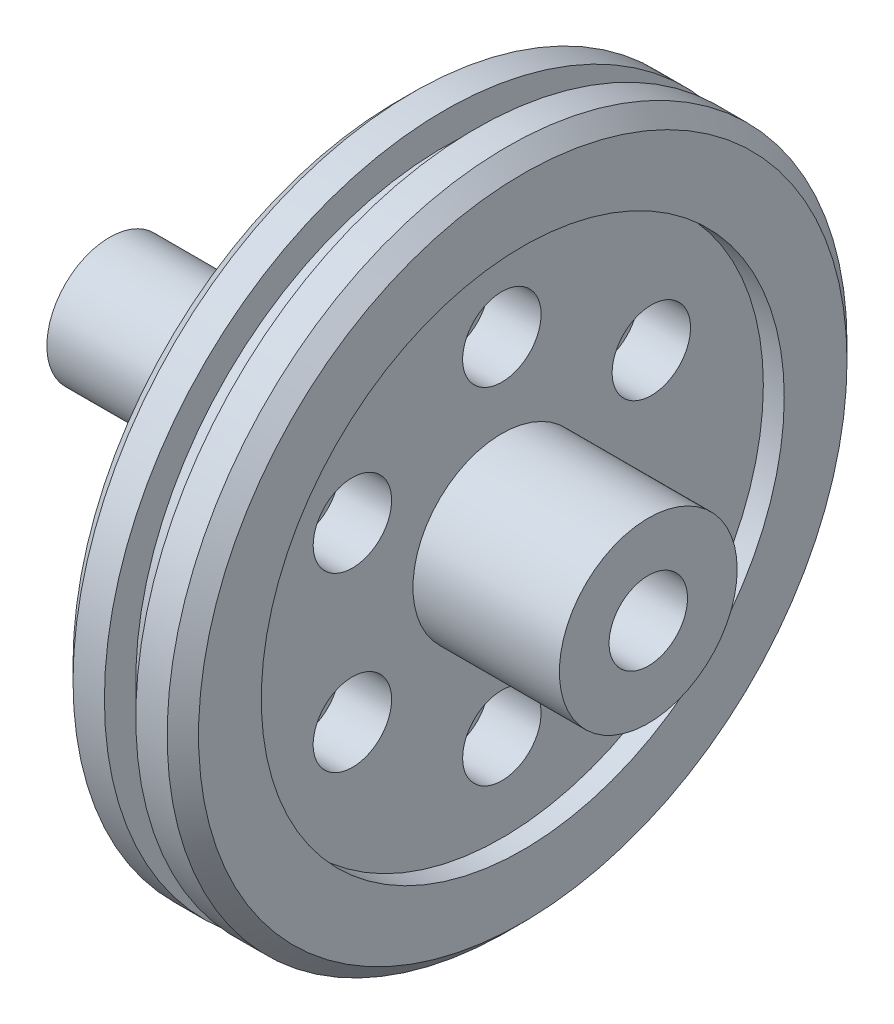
ISO-10303-21;
HEADER;
FILE_DESCRIPTION(('STEP AP214'),'2;1');
FILE_NAME('part.step','',(''),(''),'','','');
FILE_SCHEMA(('AUTOMOTIVE_DESIGN { 1 0 10303 214 1 1 1 1 }'));
ENDSEC;
DATA;
#1=APPLICATION_CONTEXT('core data for automotive mechanical design processes');
#2=APPLICATION_PROTOCOL_DEFINITION('international standard','automotive_design',2000,#1);
#3=PRODUCT_CONTEXT('',#1,'mechanical');
#4=PRODUCT('Part','Part','',(#3));
#5=PRODUCT_RELATED_PRODUCT_CATEGORY('part','',(#4));
#6=PRODUCT_DEFINITION_FORMATION('','',#4);
#7=PRODUCT_DEFINITION_CONTEXT('part definition',#1,'design');
#8=PRODUCT_DEFINITION('design','',#6,#7);
#9=PRODUCT_DEFINITION_SHAPE('','',#8);
#10=(LENGTH_UNIT() NAMED_UNIT(*) SI_UNIT(.MILLI.,.METRE.));
#11=(NAMED_UNIT(*) PLANE_ANGLE_UNIT() SI_UNIT($,.RADIAN.));
#12=(NAMED_UNIT(*) SI_UNIT($,.STERADIAN.) SOLID_ANGLE_UNIT());
#13=UNCERTAINTY_MEASURE_WITH_UNIT(LENGTH_MEASURE(1.E-05),#10,'distance_accuracy_value','');
#14=(GEOMETRIC_REPRESENTATION_CONTEXT(3) GLOBAL_UNCERTAINTY_ASSIGNED_CONTEXT((#13)) GLOBAL_UNIT_ASSIGNED_CONTEXT((#10,
#11,#12)) REPRESENTATION_CONTEXT('',''));
#15=CARTESIAN_POINT('',(0.,0.,0.));
#16=DIRECTION('',(0.,0.,1.));
#17=DIRECTION('',(1.,0.,0.));
#18=AXIS2_PLACEMENT_3D('',#15,#16,#17);
#19=CARTESIAN_POINT('',(80.,0.,0.));
#20=DIRECTION('',(1.,0.,0.));
#21=DIRECTION('',(0.,0.,-1.));
#22=AXIS2_PLACEMENT_3D('',#19,#20,#21);
#23=CYLINDRICAL_SURFACE('',#22,65.);
#24=CARTESIAN_POINT('',(-27.,0.,0.));
#25=DIRECTION('',(1.,0.,0.));
#26=DIRECTION('',(0.,0.,-1.));
#27=AXIS2_PLACEMENT_3D('',#24,#25,#26);
#28=CIRCLE('',#27,65.);
#29=CARTESIAN_POINT('',(-27.,0.,-65.));
#30=VERTEX_POINT('',#29);
#31=EDGE_CURVE('E84',#30,#30,#28,.F.);
#32=ORIENTED_EDGE('',*,*,#31,.T.);
#33=EDGE_LOOP('',(#32));
#34=FACE_BOUND('',#33,.T.);
#35=CARTESIAN_POINT('',(-33.,0.,0.));
#36=DIRECTION('',(1.,0.,0.));
#37=DIRECTION('',(0.,0.,-1.));
#38=AXIS2_PLACEMENT_3D('',#35,#36,#37);
#39=CIRCLE('',#38,65.);
#40=CARTESIAN_POINT('',(-33.,0.,-65.));
#41=VERTEX_POINT('',#40);
#42=EDGE_CURVE('E71',#41,#41,#39,.F.);
#43=ORIENTED_EDGE('',*,*,#42,.F.);
#44=EDGE_LOOP('',(#43));
#45=FACE_BOUND('',#44,.T.);
#46=ADVANCED_FACE('F24',(#34,#45),#23,.T.);
#47=CARTESIAN_POINT('',(-24.,17.,0.));
#48=DIRECTION('',(1.,0.,0.));
#49=DIRECTION('',(0.,0.,-1.));
#50=AXIS2_PLACEMENT_3D('',#47,#48,#49);
#51=PLANE('',#50);
#52=CARTESIAN_POINT('',(-24.,0.,0.));
#53=DIRECTION('',(1.,0.,0.));
#54=DIRECTION('',(0.,0.,-1.));
#55=AXIS2_PLACEMENT_3D('',#52,#53,#54);
#56=CIRCLE('',#55,50.);
#57=CARTESIAN_POINT('',(-24.,0.,-50.));
#58=VERTEX_POINT('',#57);
#59=EDGE_CURVE('E48',#58,#58,#56,.T.);
#60=ORIENTED_EDGE('',*,*,#59,.F.);
#61=EDGE_LOOP('',(#60));
#62=FACE_BOUND('',#61,.T.);
#63=CARTESIAN_POINT('',(-24.,0.,0.));
#64=DIRECTION('',(1.,0.,0.));
#65=DIRECTION('',(0.,0.,-1.));
#66=AXIS2_PLACEMENT_3D('',#63,#64,#65);
#67=CIRCLE('',#66,61.9999999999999);
#68=CARTESIAN_POINT('',(-24.,0.,-61.9999999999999));
#69=VERTEX_POINT('',#68);
#70=EDGE_CURVE('E77',#69,#69,#67,.T.);
#71=ORIENTED_EDGE('',*,*,#70,.T.);
#72=EDGE_LOOP('',(#71));
#73=FACE_BOUND('',#72,.T.);
#74=ADVANCED_FACE('F166',(#62,#73),#51,.T.);
#75=CARTESIAN_POINT('',(-33.,70.,0.));
#76=DIRECTION('',(1.,0.,0.));
#77=DIRECTION('',(0.,0.,-1.));
#78=AXIS2_PLACEMENT_3D('',#75,#76,#77);
#79=PLANE('',#78);
#80=ORIENTED_EDGE('',*,*,#42,.T.);
#81=EDGE_LOOP('',(#80));
#82=FACE_BOUND('',#81,.T.);
#83=CARTESIAN_POINT('',(-33.,0.,0.));
#84=DIRECTION('',(1.,0.,0.));
#85=DIRECTION('',(0.,0.,-1.));
#86=AXIS2_PLACEMENT_3D('',#83,#84,#85);
#87=CIRCLE('',#86,59.);
#88=CARTESIAN_POINT('',(-33.,0.,-59.));
#89=VERTEX_POINT('',#88);
#90=EDGE_CURVE('E63',#89,#89,#87,.T.);
#91=ORIENTED_EDGE('',*,*,#90,.T.);
#92=EDGE_LOOP('',(#91));
#93=FACE_BOUND('',#92,.T.);
#94=ADVANCED_FACE('F169',(#82,#93),#79,.F.);
#95=CARTESIAN_POINT('',(20.,0.,0.));
#96=DIRECTION('',(1.,0.,0.));
#97=DIRECTION('',(0.,0.,-1.));
#98=AXIS2_PLACEMENT_3D('',#95,#96,#97);
#99=CYLINDRICAL_SURFACE('',#98,59.);
#100=ORIENTED_EDGE('',*,*,#90,.F.);
#101=EDGE_LOOP('',(#100));
#102=FACE_BOUND('',#101,.T.);
#103=CARTESIAN_POINT('',(-39.,0.,0.));
#104=DIRECTION('',(1.,0.,0.));
#105=DIRECTION('',(0.,0.,-1.));
#106=AXIS2_PLACEMENT_3D('',#103,#104,#105);
#107=CIRCLE('',#106,59.);
#108=CARTESIAN_POINT('',(-39.,0.,-59.));
#109=VERTEX_POINT('',#108);
#110=EDGE_CURVE('E60',#109,#109,#107,.T.);
#111=ORIENTED_EDGE('',*,*,#110,.T.);
#112=EDGE_LOOP('',(#111));
#113=FACE_BOUND('',#112,.T.);
#114=ADVANCED_FACE('F208',(#102,#113),#99,.T.);
#115=CARTESIAN_POINT('',(-39.,70.,0.));
#116=DIRECTION('',(-1.,0.,0.));
#117=DIRECTION('',(0.,0.,1.));
#118=AXIS2_PLACEMENT_3D('',#115,#116,#117);
#119=PLANE('',#118);
#120=CARTESIAN_POINT('',(-39.,0.,0.));
#121=DIRECTION('',(-1.,0.,0.));
#122=DIRECTION('',(0.,0.,1.));
#123=AXIS2_PLACEMENT_3D('',#120,#121,#122);
#124=CIRCLE('',#123,65.);
#125=CARTESIAN_POINT('',(-39.,0.,65.));
#126=VERTEX_POINT('',#125);
#127=EDGE_CURVE('E66',#126,#126,#124,.F.);
#128=ORIENTED_EDGE('',*,*,#127,.T.);
#129=EDGE_LOOP('',(#128));
#130=FACE_BOUND('',#129,.T.);
#131=ORIENTED_EDGE('',*,*,#110,.F.);
#132=EDGE_LOOP('',(#131));
#133=FACE_BOUND('',#132,.T.);
#134=ADVANCED_FACE('F197',(#130,#133),#119,.F.);
#135=CARTESIAN_POINT('',(-48.,65.,0.));
#136=DIRECTION('',(-1.,0.,0.));
#137=DIRECTION('',(0.,0.,1.));
#138=AXIS2_PLACEMENT_3D('',#135,#136,#137);
#139=PLANE('',#138);
#140=CARTESIAN_POINT('',(-48.,0.,0.));
#141=DIRECTION('',(-1.,0.,0.));
#142=DIRECTION('',(0.,0.,1.));
#143=AXIS2_PLACEMENT_3D('',#140,#141,#142);
#144=CIRCLE('',#143,46.5);
#145=CARTESIAN_POINT('',(-48.,0.,46.5));
#146=VERTEX_POINT('',#145);
#147=EDGE_CURVE('E115',#146,#146,#144,.T.);
#148=ORIENTED_EDGE('',*,*,#147,.F.);
#149=EDGE_LOOP('',(#148));
#150=FACE_BOUND('',#149,.T.);
#151=CARTESIAN_POINT('',(-48.,0.,0.));
#152=DIRECTION('',(-1.,0.,0.));
#153=DIRECTION('',(0.,0.,1.));
#154=AXIS2_PLACEMENT_3D('',#151,#152,#153);
#155=CIRCLE('',#154,62.);
#156=CARTESIAN_POINT('',(-48.,0.,62.));
#157=VERTEX_POINT('',#156);
#158=EDGE_CURVE('E90',#157,#157,#155,.T.);
#159=ORIENTED_EDGE('',*,*,#158,.T.);
#160=EDGE_LOOP('',(#159));
#161=FACE_BOUND('',#160,.T.);
#162=ADVANCED_FACE('F184',(#150,#161),#139,.T.);
#163=CARTESIAN_POINT('',(-44.9999999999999,0.,0.));
#164=DIRECTION('',(-1.,0.,0.));
#165=DIRECTION('',(0.,0.,1.));
#166=AXIS2_PLACEMENT_3D('',#163,#164,#165);
#167=CIRCLE('',#166,65.);
#168=CARTESIAN_POINT('',(-44.9999999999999,0.,65.));
#169=VERTEX_POINT('',#168);
#170=EDGE_CURVE('E87',#169,#169,#167,.F.);
#171=ORIENTED_EDGE('',*,*,#170,.T.);
#172=EDGE_LOOP('',(#171));
#173=FACE_BOUND('',#172,.T.);
#174=ORIENTED_EDGE('',*,*,#127,.F.);
#175=EDGE_LOOP('',(#174));
#176=FACE_BOUND('',#175,.T.);
#177=ADVANCED_FACE('F175',(#173,#176),#23,.T.);
#178=CARTESIAN_POINT('',(-24.,0.,0.));
#179=DIRECTION('',(-1.,0.,0.));
#180=DIRECTION('',(0.,0.,1.));
#181=AXIS2_PLACEMENT_3D('',#178,#179,#180);
#182=CONICAL_SURFACE('',#181,62.,0.785398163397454);
#183=ORIENTED_EDGE('',*,*,#31,.F.);
#184=EDGE_LOOP('',(#183));
#185=FACE_BOUND('',#184,.T.);
#186=ORIENTED_EDGE('',*,*,#70,.F.);
#187=EDGE_LOOP('',(#186));
#188=FACE_BOUND('',#187,.T.);
#189=ADVANCED_FACE('F173',(#185,#188),#182,.T.);
#190=CARTESIAN_POINT('',(-44.9999999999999,0.,0.));
#191=DIRECTION('',(1.,0.,0.));
#192=DIRECTION('',(0.,0.,-1.));
#193=AXIS2_PLACEMENT_3D('',#190,#191,#192);
#194=CONICAL_SURFACE('',#193,65.,0.785398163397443);
#195=ORIENTED_EDGE('',*,*,#158,.F.);
#196=EDGE_LOOP('',(#195));
#197=FACE_BOUND('',#196,.T.);
#198=ORIENTED_EDGE('',*,*,#170,.F.);
#199=EDGE_LOOP('',(#198));
#200=FACE_BOUND('',#199,.T.);
#201=ADVANCED_FACE('F162',(#197,#200),#194,.T.);
#202=CARTESIAN_POINT('',(-28.,0.,0.));
#203=DIRECTION('',(1.,0.,0.));
#204=DIRECTION('',(0.,0.,-1.));
#205=AXIS2_PLACEMENT_3D('',#202,#203,#204);
#206=CYLINDRICAL_SURFACE('',#205,50.);
#207=CARTESIAN_POINT('',(-28.,0.,0.));
#208=DIRECTION('',(1.,0.,0.));
#209=DIRECTION('',(0.,0.,-1.));
#210=AXIS2_PLACEMENT_3D('',#207,#208,#209);
#211=CIRCLE('',#210,50.);
#212=CARTESIAN_POINT('',(-28.,0.,-50.));
#213=VERTEX_POINT('',#212);
#214=EDGE_CURVE('E57',#213,#213,#211,.T.);
#215=ORIENTED_EDGE('',*,*,#214,.F.);
#216=EDGE_LOOP('',(#215));
#217=FACE_BOUND('',#216,.T.);
#218=ORIENTED_EDGE('',*,*,#59,.T.);
#219=EDGE_LOOP('',(#218));
#220=FACE_BOUND('',#219,.T.);
#221=ADVANCED_FACE('F155',(#217,#220),#206,.F.);
#222=CARTESIAN_POINT('',(-28.,0.,0.));
#223=DIRECTION('',(1.,0.,0.));
#224=DIRECTION('',(0.,0.,-1.));
#225=AXIS2_PLACEMENT_3D('',#222,#223,#224);
#226=PLANE('',#225);
#227=CARTESIAN_POINT('',(-28.,16.5000000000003,-28.5788383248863));
#228=DIRECTION('',(1.,0.,0.));
#229=DIRECTION('',(0.,-0.866025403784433,-0.50000000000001));
#230=AXIS2_PLACEMENT_3D('',#227,#228,#229);
#231=CIRCLE('',#230,7.5);
#232=CARTESIAN_POINT('',(-28.,10.0048094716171,-32.3288383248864));
#233=VERTEX_POINT('',#232);
#234=EDGE_CURVE('E433',#233,#233,#231,.T.);
#235=ORIENTED_EDGE('',*,*,#234,.F.);
#236=EDGE_LOOP('',(#235));
#237=FACE_BOUND('',#236,.T.);
#238=CARTESIAN_POINT('',(-28.,-16.4999999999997,-28.5788383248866));
#239=DIRECTION('',(1.,0.,0.));
#240=DIRECTION('',(0.,-0.866025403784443,0.499999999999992));
#241=AXIS2_PLACEMENT_3D('',#238,#239,#240);
#242=CIRCLE('',#241,7.5);
#243=CARTESIAN_POINT('',(-28.,-22.9951905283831,-24.8288383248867));
#244=VERTEX_POINT('',#243);
#245=EDGE_CURVE('E432',#244,#244,#242,.T.);
#246=ORIENTED_EDGE('',*,*,#245,.F.);
#247=EDGE_LOOP('',(#246));
#248=FACE_BOUND('',#247,.T.);
#249=CARTESIAN_POINT('',(-28.,-33.,-2.30437901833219E-13));
#250=DIRECTION('',(1.,0.,0.));
#251=DIRECTION('',(0.,0.,1.));
#252=AXIS2_PLACEMENT_3D('',#249,#250,#251);
#253=CIRCLE('',#252,7.5);
#254=CARTESIAN_POINT('',(-28.,-33.0000000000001,7.49999999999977));
#255=VERTEX_POINT('',#254);
#256=EDGE_CURVE('E443',#255,#255,#253,.T.);
#257=ORIENTED_EDGE('',*,*,#256,.F.);
#258=EDGE_LOOP('',(#257));
#259=FACE_BOUND('',#258,.T.);
#260=CARTESIAN_POINT('',(-28.,-16.5000000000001,28.5788383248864));
#261=DIRECTION('',(1.,0.,0.));
#262=DIRECTION('',(0.,0.866025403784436,0.500000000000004));
#263=AXIS2_PLACEMENT_3D('',#260,#261,#262);
#264=CIRCLE('',#263,7.5);
#265=CARTESIAN_POINT('',(-28.,-10.0048094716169,32.3288383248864));
#266=VERTEX_POINT('',#265);
#267=EDGE_CURVE('E449',#266,#266,#264,.T.);
#268=ORIENTED_EDGE('',*,*,#267,.F.);
#269=EDGE_LOOP('',(#268));
#270=FACE_BOUND('',#269,.T.);
#271=CARTESIAN_POINT('',(-28.,16.4999999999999,28.5788383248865));
#272=DIRECTION('',(1.,0.,0.));
#273=DIRECTION('',(0.,0.86602540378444,-0.499999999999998));
#274=AXIS2_PLACEMENT_3D('',#271,#272,#273);
#275=CIRCLE('',#274,7.5);
#276=CARTESIAN_POINT('',(-28.,22.9951905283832,24.8288383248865));
#277=VERTEX_POINT('',#276);
#278=EDGE_CURVE('E455',#277,#277,#275,.T.);
#279=ORIENTED_EDGE('',*,*,#278,.F.);
#280=EDGE_LOOP('',(#279));
#281=FACE_BOUND('',#280,.T.);
#282=CARTESIAN_POINT('',(-28.,33.,0.));
#283=DIRECTION('',(1.,0.,0.));
#284=DIRECTION('',(0.,0.,-1.));
#285=AXIS2_PLACEMENT_3D('',#282,#283,#284);
#286=CIRCLE('',#285,7.5);
#287=CARTESIAN_POINT('',(-28.,33.,-7.5));
#288=VERTEX_POINT('',#287);
#289=EDGE_CURVE('E122',#288,#288,#286,.T.);
#290=ORIENTED_EDGE('',*,*,#289,.F.);
#291=EDGE_LOOP('',(#290));
#292=FACE_BOUND('',#291,.T.);
#293=CARTESIAN_POINT('',(-28.,0.,0.));
#294=DIRECTION('',(1.,0.,0.));
#295=DIRECTION('',(0.,0.,-1.));
#296=AXIS2_PLACEMENT_3D('',#293,#294,#295);
#297=CIRCLE('',#296,17.);
#298=CARTESIAN_POINT('',(-28.,0.,-17.));
#299=VERTEX_POINT('',#298);
#300=EDGE_CURVE('E44',#299,#299,#297,.T.);
#301=ORIENTED_EDGE('',*,*,#300,.F.);
#302=EDGE_LOOP('',(#301));
#303=FACE_BOUND('',#302,.T.);
#304=ORIENTED_EDGE('',*,*,#214,.T.);
#305=EDGE_LOOP('',(#304));
#306=FACE_BOUND('',#305,.T.);
#307=ADVANCED_FACE('F145',(#237,#248,#259,#270,#281,#292,#303,#306),#226,.T.);
#308=CARTESIAN_POINT('',(0.,0.,0.));
#309=DIRECTION('',(1.,0.,0.));
#310=DIRECTION('',(0.,0.,-1.));
#311=AXIS2_PLACEMENT_3D('',#308,#309,#310);
#312=PLANE('',#311);
#313=CARTESIAN_POINT('',(0.,0.,0.));
#314=DIRECTION('',(1.,0.,0.));
#315=DIRECTION('',(0.,0.,-1.));
#316=AXIS2_PLACEMENT_3D('',#313,#314,#315);
#317=CIRCLE('',#316,7.5);
#318=CARTESIAN_POINT('',(0.,0.,-7.5));
#319=VERTEX_POINT('',#318);
#320=EDGE_CURVE('E99',#319,#319,#317,.T.);
#321=ORIENTED_EDGE('',*,*,#320,.F.);
#322=EDGE_LOOP('',(#321));
#323=FACE_BOUND('',#322,.T.);
#324=CARTESIAN_POINT('',(0.,0.,0.));
#325=DIRECTION('',(1.,0.,0.));
#326=DIRECTION('',(0.,0.,-1.));
#327=AXIS2_PLACEMENT_3D('',#324,#325,#326);
#328=CIRCLE('',#327,17.);
#329=CARTESIAN_POINT('',(0.,0.,-17.));
#330=VERTEX_POINT('',#329);
#331=EDGE_CURVE('E74',#330,#330,#328,.T.);
#332=ORIENTED_EDGE('',*,*,#331,.T.);
#333=EDGE_LOOP('',(#332));
#334=FACE_BOUND('',#333,.T.);
#335=ADVANCED_FACE('F142',(#323,#334),#312,.T.);
#336=CARTESIAN_POINT('',(80.,0.,0.));
#337=DIRECTION('',(1.,0.,0.));
#338=DIRECTION('',(0.,0.,-1.));
#339=AXIS2_PLACEMENT_3D('',#336,#337,#338);
#340=CYLINDRICAL_SURFACE('',#339,17.);
#341=ORIENTED_EDGE('',*,*,#331,.F.);
#342=EDGE_LOOP('',(#341));
#343=FACE_BOUND('',#342,.T.);
#344=ORIENTED_EDGE('',*,*,#300,.T.);
#345=EDGE_LOOP('',(#344));
#346=FACE_BOUND('',#345,.T.);
#347=ADVANCED_FACE('F38',(#343,#346),#340,.T.);
#348=CARTESIAN_POINT('',(-29.,0.,0.));
#349=DIRECTION('',(1.,0.,0.));
#350=DIRECTION('',(0.,0.,-1.));
#351=AXIS2_PLACEMENT_3D('',#348,#349,#350);
#352=CONICAL_SURFACE('',#351,6.,1.02974425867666);
#353=CARTESIAN_POINT('',(-32.6051637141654,0.,0.));
#354=VERTEX_POINT('',#353);
#355=VERTEX_LOOP('',#354);
#356=FACE_BOUND('',#355,.T.);
#357=CARTESIAN_POINT('',(-29.,0.,0.));
#358=DIRECTION('',(1.,0.,0.));
#359=DIRECTION('',(0.,0.,-1.));
#360=AXIS2_PLACEMENT_3D('',#357,#358,#359);
#361=CIRCLE('',#360,6.);
#362=CARTESIAN_POINT('',(-29.,0.,-6.));
#363=VERTEX_POINT('',#362);
#364=EDGE_CURVE('E42',#363,#363,#361,.T.);
#365=ORIENTED_EDGE('',*,*,#364,.T.);
#366=EDGE_LOOP('',(#365));
#367=FACE_BOUND('',#366,.T.);
#368=ADVANCED_FACE('F34',(#356,#367),#352,.F.);
#369=CARTESIAN_POINT('',(0.,0.,0.));
#370=DIRECTION('',(1.,0.,0.));
#371=DIRECTION('',(0.,0.,-1.));
#372=AXIS2_PLACEMENT_3D('',#369,#370,#371);
#373=CYLINDRICAL_SURFACE('',#372,6.);
#374=ORIENTED_EDGE('',*,*,#364,.F.);
#375=EDGE_LOOP('',(#374));
#376=FACE_BOUND('',#375,.T.);
#377=CARTESIAN_POINT('',(-22.5,0.,0.));
#378=DIRECTION('',(1.,0.,0.));
#379=DIRECTION('',(0.,0.,-1.));
#380=AXIS2_PLACEMENT_3D('',#377,#378,#379);
#381=CIRCLE('',#380,6.);
#382=CARTESIAN_POINT('',(-22.5,0.,-6.));
#383=VERTEX_POINT('',#382);
#384=EDGE_CURVE('E45',#383,#383,#381,.T.);
#385=ORIENTED_EDGE('',*,*,#384,.T.);
#386=EDGE_LOOP('',(#385));
#387=FACE_BOUND('',#386,.T.);
#388=ADVANCED_FACE('F37',(#376,#387),#373,.F.);
#389=CARTESIAN_POINT('',(-21.,0.,0.));
#390=DIRECTION('',(1.,0.,0.));
#391=DIRECTION('',(0.,0.,-1.));
#392=AXIS2_PLACEMENT_3D('',#389,#390,#391);
#393=CONICAL_SURFACE('',#392,7.5,0.785398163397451);
#394=ORIENTED_EDGE('',*,*,#384,.F.);
#395=EDGE_LOOP('',(#394));
#396=FACE_BOUND('',#395,.T.);
#397=CARTESIAN_POINT('',(-21.,0.,0.));
#398=DIRECTION('',(1.,0.,0.));
#399=DIRECTION('',(0.,0.,-1.));
#400=AXIS2_PLACEMENT_3D('',#397,#398,#399);
#401=CIRCLE('',#400,7.5);
#402=CARTESIAN_POINT('',(-21.,0.,-7.5));
#403=VERTEX_POINT('',#402);
#404=EDGE_CURVE('E51',#403,#403,#401,.T.);
#405=ORIENTED_EDGE('',*,*,#404,.T.);
#406=EDGE_LOOP('',(#405));
#407=FACE_BOUND('',#406,.T.);
#408=ADVANCED_FACE('F134',(#396,#407),#393,.F.);
#409=CARTESIAN_POINT('',(0.,0.,0.));
#410=DIRECTION('',(1.,0.,0.));
#411=DIRECTION('',(0.,0.,-1.));
#412=AXIS2_PLACEMENT_3D('',#409,#410,#411);
#413=CYLINDRICAL_SURFACE('',#412,7.5);
#414=ORIENTED_EDGE('',*,*,#404,.F.);
#415=EDGE_LOOP('',(#414));
#416=FACE_BOUND('',#415,.T.);
#417=ORIENTED_EDGE('',*,*,#320,.T.);
#418=EDGE_LOOP('',(#417));
#419=FACE_BOUND('',#418,.T.);
#420=ADVANCED_FACE('F136',(#416,#419),#413,.F.);
#421=CARTESIAN_POINT('',(-44.,0.,0.));
#422=DIRECTION('',(-1.,0.,0.));
#423=DIRECTION('',(0.,0.,1.));
#424=AXIS2_PLACEMENT_3D('',#421,#422,#423);
#425=PLANE('',#424);
#426=CARTESIAN_POINT('',(-44.,0.,0.));
#427=DIRECTION('',(-1.,0.,0.));
#428=DIRECTION('',(0.,0.,1.));
#429=AXIS2_PLACEMENT_3D('',#426,#427,#428);
#430=CIRCLE('',#429,42.5);
#431=CARTESIAN_POINT('',(-44.,0.,42.5));
#432=VERTEX_POINT('',#431);
#433=EDGE_CURVE('E11',#432,#432,#430,.T.);
#434=ORIENTED_EDGE('',*,*,#433,.T.);
#435=EDGE_LOOP('',(#434));
#436=FACE_BOUND('',#435,.T.);
#437=CARTESIAN_POINT('',(-44.,0.,0.));
#438=DIRECTION('',(-1.,0.,0.));
#439=DIRECTION('',(0.,0.,1.));
#440=AXIS2_PLACEMENT_3D('',#437,#438,#439);
#441=CIRCLE('',#440,23.);
#442=CARTESIAN_POINT('',(-44.,0.,23.));
#443=VERTEX_POINT('',#442);
#444=EDGE_CURVE('E31',#443,#443,#441,.F.);
#445=ORIENTED_EDGE('',*,*,#444,.T.);
#446=EDGE_LOOP('',(#445));
#447=FACE_BOUND('',#446,.T.);
#448=ADVANCED_FACE('F103',(#436,#447),#425,.T.);
#449=CARTESIAN_POINT('',(-80.5000000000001,0.,0.));
#450=DIRECTION('',(0.,0.,1.));
#451=DIRECTION('',(1.,0.,0.));
#452=AXIS2_PLACEMENT_3D('',#449,#450,#451);
#453=SPHERICAL_SURFACE('',#452,25.4999999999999);
#454=CARTESIAN_POINT('',(-80.5000000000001,0.,0.));
#455=DIRECTION('',(1.,0.,0.));
#456=DIRECTION('',(0.,0.,-1.));
#457=AXIS2_PLACEMENT_3D('',#454,#455,#456);
#458=SPHERICAL_SURFACE('',#457,25.4999999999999);
#459=CARTESIAN_POINT('',(-103.,0.,0.));
#460=DIRECTION('',(1.,0.,0.));
#461=DIRECTION('',(0.,0.,-1.));
#462=AXIS2_PLACEMENT_3D('',#459,#460,#461);
#463=CIRCLE('',#462,12.);
#464=CARTESIAN_POINT('',(-103.,0.,-12.));
#465=VERTEX_POINT('',#464);
#466=EDGE_CURVE('E67',#465,#465,#463,.T.);
#467=ORIENTED_EDGE('',*,*,#466,.F.);
#468=EDGE_LOOP('',(#467));
#469=FACE_BOUND('',#468,.T.);
#470=ADVANCED_FACE('F26',(#469),#458,.T.);
#471=CARTESIAN_POINT('',(80.,0.,0.));
#472=DIRECTION('',(1.,0.,0.));
#473=DIRECTION('',(0.,0.,-1.));
#474=AXIS2_PLACEMENT_3D('',#471,#472,#473);
#475=CYLINDRICAL_SURFACE('',#474,12.);
#476=CARTESIAN_POINT('',(-70.,0.,0.));
#477=DIRECTION('',(-1.,0.,0.));
#478=DIRECTION('',(0.,0.,1.));
#479=AXIS2_PLACEMENT_3D('',#476,#477,#478);
#480=CIRCLE('',#479,12.);
#481=CARTESIAN_POINT('',(-70.,0.,12.));
#482=VERTEX_POINT('',#481);
#483=EDGE_CURVE('E93',#482,#482,#480,.F.);
#484=ORIENTED_EDGE('',*,*,#483,.F.);
#485=EDGE_LOOP('',(#484));
#486=FACE_BOUND('',#485,.T.);
#487=ORIENTED_EDGE('',*,*,#466,.T.);
#488=EDGE_LOOP('',(#487));
#489=FACE_BOUND('',#488,.T.);
#490=ADVANCED_FACE('F200',(#486,#489),#475,.T.);
#491=CARTESIAN_POINT('',(-70.,20.,0.));
#492=DIRECTION('',(-1.,0.,0.));
#493=DIRECTION('',(0.,0.,1.));
#494=AXIS2_PLACEMENT_3D('',#491,#492,#493);
#495=PLANE('',#494);
#496=ORIENTED_EDGE('',*,*,#483,.T.);
#497=EDGE_LOOP('',(#496));
#498=FACE_BOUND('',#497,.T.);
#499=CARTESIAN_POINT('',(-70.,0.,0.));
#500=DIRECTION('',(1.,0.,0.));
#501=DIRECTION('',(0.,0.,-1.));
#502=AXIS2_PLACEMENT_3D('',#499,#500,#501);
#503=CIRCLE('',#502,9.);
#504=CARTESIAN_POINT('',(-70.,0.,-9.));
#505=VERTEX_POINT('',#504);
#506=EDGE_CURVE('E119',#505,#505,#503,.T.);
#507=ORIENTED_EDGE('',*,*,#506,.F.);
#508=EDGE_LOOP('',(#507));
#509=FACE_BOUND('',#508,.T.);
#510=ADVANCED_FACE('F203',(#498,#509),#495,.F.);
#511=CARTESIAN_POINT('',(11.7710809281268,0.,0.));
#512=DIRECTION('',(1.,0.,0.));
#513=DIRECTION('',(0.,0.,-1.));
#514=AXIS2_PLACEMENT_3D('',#511,#512,#513);
#515=CYLINDRICAL_SURFACE('',#514,9.);
#516=CARTESIAN_POINT('',(-67.,0.,0.));
#517=DIRECTION('',(1.,0.,0.));
#518=DIRECTION('',(0.,0.,-1.));
#519=AXIS2_PLACEMENT_3D('',#516,#517,#518);
#520=CIRCLE('',#519,9.);
#521=CARTESIAN_POINT('',(-67.,0.,-9.));
#522=VERTEX_POINT('',#521);
#523=EDGE_CURVE('E97',#522,#522,#520,.T.);
#524=ORIENTED_EDGE('',*,*,#523,.F.);
#525=EDGE_LOOP('',(#524));
#526=FACE_BOUND('',#525,.T.);
#527=ORIENTED_EDGE('',*,*,#506,.T.);
#528=EDGE_LOOP('',(#527));
#529=FACE_BOUND('',#528,.T.);
#530=ADVANCED_FACE('F296',(#526,#529),#515,.T.);
#531=CARTESIAN_POINT('',(-67.,20.,0.));
#532=DIRECTION('',(1.,0.,0.));
#533=DIRECTION('',(0.,0.,-1.));
#534=AXIS2_PLACEMENT_3D('',#531,#532,#533);
#535=PLANE('',#534);
#536=CARTESIAN_POINT('',(-67.,0.,0.));
#537=DIRECTION('',(1.,0.,0.));
#538=DIRECTION('',(0.,0.,-1.));
#539=AXIS2_PLACEMENT_3D('',#536,#537,#538);
#540=CIRCLE('',#539,12.);
#541=CARTESIAN_POINT('',(-67.,0.,-12.));
#542=VERTEX_POINT('',#541);
#543=EDGE_CURVE('E96',#542,#542,#540,.F.);
#544=ORIENTED_EDGE('',*,*,#543,.T.);
#545=EDGE_LOOP('',(#544));
#546=FACE_BOUND('',#545,.T.);
#547=ORIENTED_EDGE('',*,*,#523,.T.);
#548=EDGE_LOOP('',(#547));
#549=FACE_BOUND('',#548,.T.);
#550=ADVANCED_FACE('F304',(#546,#549),#535,.F.);
#551=ORIENTED_EDGE('',*,*,#543,.F.);
#552=EDGE_LOOP('',(#551));
#553=FACE_BOUND('',#552,.T.);
#554=CARTESIAN_POINT('',(-48.,0.,0.));
#555=DIRECTION('',(1.,0.,0.));
#556=DIRECTION('',(0.,0.,-1.));
#557=AXIS2_PLACEMENT_3D('',#554,#555,#556);
#558=CIRCLE('',#557,12.);
#559=CARTESIAN_POINT('',(-48.,0.,-12.));
#560=VERTEX_POINT('',#559);
#561=EDGE_CURVE('E70',#560,#560,#558,.T.);
#562=ORIENTED_EDGE('',*,*,#561,.F.);
#563=EDGE_LOOP('',(#562));
#564=FACE_BOUND('',#563,.T.);
#565=ADVANCED_FACE('F205',(#553,#564),#475,.T.);
#566=ORIENTED_EDGE('',*,*,#561,.T.);
#567=EDGE_LOOP('',(#566));
#568=FACE_BOUND('',#567,.T.);
#569=CARTESIAN_POINT('',(-48.,0.,0.));
#570=DIRECTION('',(-1.,0.,0.));
#571=DIRECTION('',(0.,0.,1.));
#572=AXIS2_PLACEMENT_3D('',#569,#570,#571);
#573=CIRCLE('',#572,19.);
#574=CARTESIAN_POINT('',(-48.,0.,19.));
#575=VERTEX_POINT('',#574);
#576=EDGE_CURVE('E113',#575,#575,#573,.T.);
#577=ORIENTED_EDGE('',*,*,#576,.T.);
#578=EDGE_LOOP('',(#577));
#579=FACE_BOUND('',#578,.T.);
#580=ADVANCED_FACE('F199',(#568,#579),#139,.T.);
#581=CARTESIAN_POINT('',(-48.,0.,0.));
#582=DIRECTION('',(-1.,0.,0.));
#583=DIRECTION('',(0.,0.,1.));
#584=AXIS2_PLACEMENT_3D('',#581,#582,#583);
#585=TOROIDAL_SURFACE('',#584,42.5,4.);
#586=ORIENTED_EDGE('',*,*,#147,.T.);
#587=EDGE_LOOP('',(#586));
#588=FACE_BOUND('',#587,.T.);
#589=ORIENTED_EDGE('',*,*,#433,.F.);
#590=EDGE_LOOP('',(#589));
#591=FACE_BOUND('',#590,.T.);
#592=ADVANCED_FACE('F109',(#588,#591),#585,.F.);
#593=CARTESIAN_POINT('',(-48.,0.,0.));
#594=DIRECTION('',(-1.,0.,0.));
#595=DIRECTION('',(0.,0.,1.));
#596=AXIS2_PLACEMENT_3D('',#593,#594,#595);
#597=TOROIDAL_SURFACE('',#596,23.,4.);
#598=ORIENTED_EDGE('',*,*,#444,.F.);
#599=EDGE_LOOP('',(#598));
#600=FACE_BOUND('',#599,.T.);
#601=ORIENTED_EDGE('',*,*,#576,.F.);
#602=EDGE_LOOP('',(#601));
#603=FACE_BOUND('',#602,.T.);
#604=ADVANCED_FACE('F105',(#600,#603),#597,.F.);
#605=CARTESIAN_POINT('',(-38.,33.,0.));
#606=DIRECTION('',(1.,0.,0.));
#607=DIRECTION('',(0.,0.,-1.));
#608=AXIS2_PLACEMENT_3D('',#605,#606,#607);
#609=CYLINDRICAL_SURFACE('',#608,7.5);
#610=CARTESIAN_POINT('',(-38.,33.,0.));
#611=DIRECTION('',(1.,0.,0.));
#612=DIRECTION('',(0.,0.,-1.));
#613=AXIS2_PLACEMENT_3D('',#610,#611,#612);
#614=CIRCLE('',#613,7.5);
#615=CARTESIAN_POINT('',(-38.,33.,-7.5));
#616=VERTEX_POINT('',#615);
#617=EDGE_CURVE('E116',#616,#616,#614,.T.);
#618=ORIENTED_EDGE('',*,*,#617,.F.);
#619=EDGE_LOOP('',(#618));
#620=FACE_BOUND('',#619,.T.);
#621=ORIENTED_EDGE('',*,*,#289,.T.);
#622=EDGE_LOOP('',(#621));
#623=FACE_BOUND('',#622,.T.);
#624=ADVANCED_FACE('F108',(#620,#623),#609,.F.);
#625=CARTESIAN_POINT('',(-38.,33.,0.));
#626=DIRECTION('',(1.,0.,0.));
#627=DIRECTION('',(0.,0.,-1.));
#628=AXIS2_PLACEMENT_3D('',#625,#626,#627);
#629=PLANE('',#628);
#630=ORIENTED_EDGE('',*,*,#617,.T.);
#631=EDGE_LOOP('',(#630));
#632=FACE_BOUND('',#631,.T.);
#633=ADVANCED_FACE('F339',(#632),#629,.T.);
#634=CARTESIAN_POINT('',(-38.,16.4999999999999,28.5788383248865));
#635=DIRECTION('',(1.,0.,0.));
#636=DIRECTION('',(0.,0.,-1.));
#637=AXIS2_PLACEMENT_3D('',#634,#635,#636);
#638=CYLINDRICAL_SURFACE('',#637,7.5);
#639=CARTESIAN_POINT('',(-38.,16.4999999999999,28.5788383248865));
#640=DIRECTION('',(1.,0.,0.));
#641=DIRECTION('',(0.,0.86602540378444,-0.499999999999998));
#642=AXIS2_PLACEMENT_3D('',#639,#640,#641);
#643=CIRCLE('',#642,7.5);
#644=CARTESIAN_POINT('',(-38.,22.9951905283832,24.8288383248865));
#645=VERTEX_POINT('',#644);
#646=EDGE_CURVE('E458',#645,#645,#643,.T.);
#647=ORIENTED_EDGE('',*,*,#646,.F.);
#648=EDGE_LOOP('',(#647));
#649=FACE_BOUND('',#648,.T.);
#650=ORIENTED_EDGE('',*,*,#278,.T.);
#651=EDGE_LOOP('',(#650));
#652=FACE_BOUND('',#651,.T.);
#653=ADVANCED_FACE('F347',(#649,#652),#638,.F.);
#654=CARTESIAN_POINT('',(-38.,16.4999999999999,28.5788383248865));
#655=DIRECTION('',(1.,0.,0.));
#656=DIRECTION('',(0.,0.86602540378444,-0.499999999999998));
#657=AXIS2_PLACEMENT_3D('',#654,#655,#656);
#658=PLANE('',#657);
#659=ORIENTED_EDGE('',*,*,#646,.T.);
#660=EDGE_LOOP('',(#659));
#661=FACE_BOUND('',#660,.T.);
#662=ADVANCED_FACE('F355',(#661),#658,.T.);
#663=CARTESIAN_POINT('',(-38.,-16.5000000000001,28.5788383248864));
#664=DIRECTION('',(1.,0.,0.));
#665=DIRECTION('',(0.,0.,-1.));
#666=AXIS2_PLACEMENT_3D('',#663,#664,#665);
#667=CYLINDRICAL_SURFACE('',#666,7.5);
#668=CARTESIAN_POINT('',(-38.,-16.5000000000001,28.5788383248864));
#669=DIRECTION('',(1.,0.,0.));
#670=DIRECTION('',(0.,0.866025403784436,0.500000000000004));
#671=AXIS2_PLACEMENT_3D('',#668,#669,#670);
#672=CIRCLE('',#671,7.5);
#673=CARTESIAN_POINT('',(-38.,-10.0048094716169,32.3288383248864));
#674=VERTEX_POINT('',#673);
#675=EDGE_CURVE('E452',#674,#674,#672,.T.);
#676=ORIENTED_EDGE('',*,*,#675,.F.);
#677=EDGE_LOOP('',(#676));
#678=FACE_BOUND('',#677,.T.);
#679=ORIENTED_EDGE('',*,*,#267,.T.);
#680=EDGE_LOOP('',(#679));
#681=FACE_BOUND('',#680,.T.);
#682=ADVANCED_FACE('F363',(#678,#681),#667,.F.);
#683=CARTESIAN_POINT('',(-38.,-16.5000000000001,28.5788383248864));
#684=DIRECTION('',(1.,0.,0.));
#685=DIRECTION('',(0.,0.866025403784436,0.500000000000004));
#686=AXIS2_PLACEMENT_3D('',#683,#684,#685);
#687=PLANE('',#686);
#688=ORIENTED_EDGE('',*,*,#675,.T.);
#689=EDGE_LOOP('',(#688));
#690=FACE_BOUND('',#689,.T.);
#691=ADVANCED_FACE('F371',(#690),#687,.T.);
#692=CARTESIAN_POINT('',(-38.,-33.,-2.30437901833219E-13));
#693=DIRECTION('',(1.,0.,0.));
#694=DIRECTION('',(0.,0.,-1.));
#695=AXIS2_PLACEMENT_3D('',#692,#693,#694);
#696=CYLINDRICAL_SURFACE('',#695,7.5);
#697=CARTESIAN_POINT('',(-38.,-33.,-2.30437901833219E-13));
#698=DIRECTION('',(1.,0.,0.));
#699=DIRECTION('',(0.,0.,1.));
#700=AXIS2_PLACEMENT_3D('',#697,#698,#699);
#701=CIRCLE('',#700,7.5);
#702=CARTESIAN_POINT('',(-38.,-33.0000000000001,7.49999999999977));
#703=VERTEX_POINT('',#702);
#704=EDGE_CURVE('E446',#703,#703,#701,.T.);
#705=ORIENTED_EDGE('',*,*,#704,.F.);
#706=EDGE_LOOP('',(#705));
#707=FACE_BOUND('',#706,.T.);
#708=ORIENTED_EDGE('',*,*,#256,.T.);
#709=EDGE_LOOP('',(#708));
#710=FACE_BOUND('',#709,.T.);
#711=ADVANCED_FACE('F379',(#707,#710),#696,.F.);
#712=CARTESIAN_POINT('',(-38.,-33.,-2.30437901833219E-13));
#713=DIRECTION('',(1.,0.,0.));
#714=DIRECTION('',(0.,0.,1.));
#715=AXIS2_PLACEMENT_3D('',#712,#713,#714);
#716=PLANE('',#715);
#717=ORIENTED_EDGE('',*,*,#704,.T.);
#718=EDGE_LOOP('',(#717));
#719=FACE_BOUND('',#718,.T.);
#720=ADVANCED_FACE('F387',(#719),#716,.T.);
#721=CARTESIAN_POINT('',(-38.,-16.4999999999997,-28.5788383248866));
#722=DIRECTION('',(1.,0.,0.));
#723=DIRECTION('',(0.,0.,-1.));
#724=AXIS2_PLACEMENT_3D('',#721,#722,#723);
#725=CYLINDRICAL_SURFACE('',#724,7.5);
#726=CARTESIAN_POINT('',(-38.,-16.4999999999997,-28.5788383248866));
#727=DIRECTION('',(1.,0.,0.));
#728=DIRECTION('',(0.,-0.866025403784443,0.499999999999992));
#729=AXIS2_PLACEMENT_3D('',#726,#727,#728);
#730=CIRCLE('',#729,7.5);
#731=CARTESIAN_POINT('',(-38.,-22.9951905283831,-24.8288383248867));
#732=VERTEX_POINT('',#731);
#733=EDGE_CURVE('E436',#732,#732,#730,.T.);
#734=ORIENTED_EDGE('',*,*,#733,.F.);
#735=EDGE_LOOP('',(#734));
#736=FACE_BOUND('',#735,.T.);
#737=ORIENTED_EDGE('',*,*,#245,.T.);
#738=EDGE_LOOP('',(#737));
#739=FACE_BOUND('',#738,.T.);
#740=ADVANCED_FACE('F395',(#736,#739),#725,.F.);
#741=CARTESIAN_POINT('',(-38.,-16.4999999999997,-28.5788383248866));
#742=DIRECTION('',(1.,0.,0.));
#743=DIRECTION('',(0.,-0.866025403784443,0.499999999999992));
#744=AXIS2_PLACEMENT_3D('',#741,#742,#743);
#745=PLANE('',#744);
#746=ORIENTED_EDGE('',*,*,#733,.T.);
#747=EDGE_LOOP('',(#746));
#748=FACE_BOUND('',#747,.T.);
#749=ADVANCED_FACE('F403',(#748),#745,.T.);
#750=CARTESIAN_POINT('',(-38.,16.5000000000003,-28.5788383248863));
#751=DIRECTION('',(1.,0.,0.));
#752=DIRECTION('',(0.,0.,-1.));
#753=AXIS2_PLACEMENT_3D('',#750,#751,#752);
#754=CYLINDRICAL_SURFACE('',#753,7.5);
#755=CARTESIAN_POINT('',(-38.,16.5000000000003,-28.5788383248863));
#756=DIRECTION('',(1.,0.,0.));
#757=DIRECTION('',(0.,-0.866025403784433,-0.50000000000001));
#758=AXIS2_PLACEMENT_3D('',#755,#756,#757);
#759=CIRCLE('',#758,7.5);
#760=CARTESIAN_POINT('',(-38.,10.0048094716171,-32.3288383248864));
#761=VERTEX_POINT('',#760);
#762=EDGE_CURVE('E431',#761,#761,#759,.T.);
#763=ORIENTED_EDGE('',*,*,#762,.F.);
#764=EDGE_LOOP('',(#763));
#765=FACE_BOUND('',#764,.T.);
#766=ORIENTED_EDGE('',*,*,#234,.T.);
#767=EDGE_LOOP('',(#766));
#768=FACE_BOUND('',#767,.T.);
#769=ADVANCED_FACE('F411',(#765,#768),#754,.F.);
#770=CARTESIAN_POINT('',(-38.,16.5000000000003,-28.5788383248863));
#771=DIRECTION('',(1.,0.,0.));
#772=DIRECTION('',(0.,-0.866025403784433,-0.50000000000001));
#773=AXIS2_PLACEMENT_3D('',#770,#771,#772);
#774=PLANE('',#773);
#775=ORIENTED_EDGE('',*,*,#762,.T.);
#776=EDGE_LOOP('',(#775));
#777=FACE_BOUND('',#776,.T.);
#778=ADVANCED_FACE('F419',(#777),#774,.T.);
#779=CLOSED_SHELL('',(#46,#74,#94,#114,#134,#162,#177,#189,#201,#221,#307,#335,#347,#368,#388,
#408,#420,#448,#470,#490,#510,#530,#550,#565,#580,#592,#604,#624,#633,#653,#662,#682,#691,#711,
#720,#740,#749,#769,#778));
#780=MANIFOLD_SOLID_BREP('B2',#779);
#781=ADVANCED_BREP_SHAPE_REPRESENTATION('',(#18,#780),#14);
#782=SHAPE_DEFINITION_REPRESENTATION(#9,#781);
ENDSEC;
END-ISO-10303-21;
